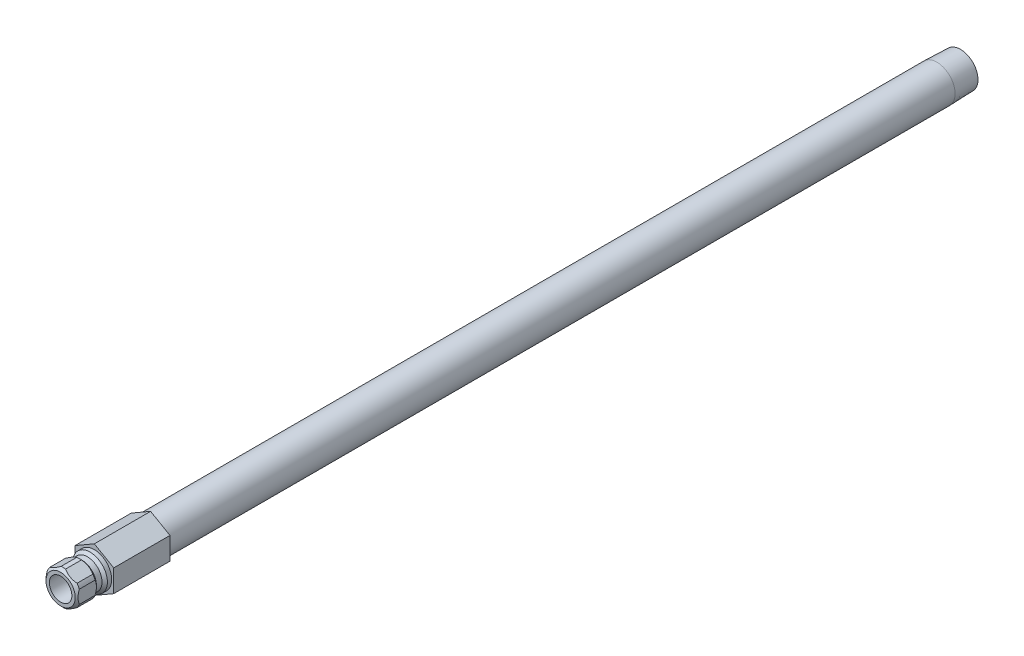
from build123d import *

# Parameters (mm, degrees)
SKETCH2_R           = 2.38125
BOSS_EXTRUDE1_DEPTH = 15.875
CUT_EXTRUDE1_START  = 3.556
SKETCH3_OUTSIDE_W   = 63.832
SKETCH3_OUTSIDE_H   = 65.522
CUT_EXTRUDE1_DEPTH  = 242.06127557


with BuildPart() as part:
    # Sketch1 → Revolve1 (revolve)
    with BuildSketch(Plane(origin=(0, 0, 0), x_dir=(0, 0, -1), z_dir=(1, 0, 0))):
        Polygon((-9.525, 3.175), (-9.525, 4.1275), (-8.763, 4.8895), (-4.318, 4.8895), (-3.556, 4.1275), (-1.9685, 4.1275), (-1.2065, 4.8895), (0, 4.8895), (0, 5.1435), (237.7948, 5.1435), (244.475, 4.934744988), (244.475, 2.38125), (0.127, 2.38125), (0.127, 3.175), align=None)
    revolve(axis=Axis((0, 0, 0), (0, 0, 1)))

    # Sketch2 → Boss-Extrude1 (add)
    with BuildSketch(Plane.XY):
        Polygon((-5.461, 3.15290982), (-5.461, -3.15290982), (0, -6.30581964), (5.461, -3.15290982), (5.461, 3.15290982), (0, 6.30581964), align=None)
        with Locations(Location((0, 0, 0), (0, 0, 90))):
            Circle(SKETCH2_R, mode=Mode.SUBTRACT)
    extrude(amount=-BOSS_EXTRUDE1_DEPTH)

    # Sketch3 outside → Cut-Extrude1 (cut, through all)
    with BuildSketch(Plane.XY.offset(CUT_EXTRUDE1_START)):
        Rectangle(SKETCH3_OUTSIDE_W, SKETCH3_OUTSIDE_H)
        Polygon((-4.5212, -2.610316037), (0, -5.220632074), (4.5212, -2.610316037), (4.5212, 2.610316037), (0, 5.220632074), (-4.5212, 2.610316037), align=None, mode=Mode.SUBTRACT)
    extrude(amount=CUT_EXTRUDE1_DEPTH, mode=Mode.SUBTRACT)


solid = part.part
